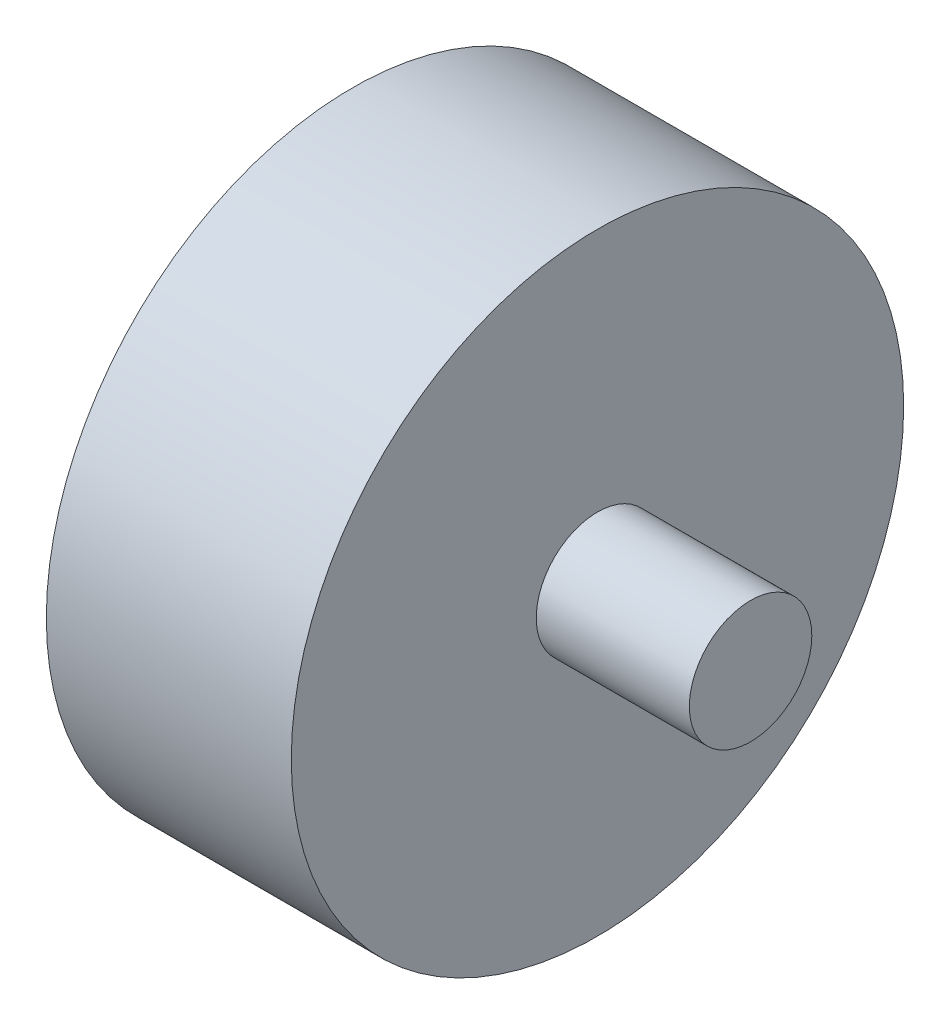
from build123d import *

# Parameters (mm, degrees)
EXTRUDE1_DEPTH      = 5.08
EXTRUDE1_DEPTH_BACK = 5.08
SKETCH1_R           = 12.7
SKETCH2_R           = 2.54
EXTRUDE2_DEPTH      = 6.35
EXTRUDE3_START      = 6.35
SKETCH3_R           = 2.54
EXTRUDE3_DEPTH      = 6.35


with BuildPart() as part:
    # Sketch1 → Extrude1 (new, two sides: drawn at the far end of the back side and taken through both)
    with BuildSketch(Plane(origin=(0, 0, 0), x_dir=(0, 0, -1), z_dir=(1, 0, 0)).offset(-EXTRUDE1_DEPTH_BACK)):
        Circle(SKETCH1_R)
    extrude(amount=EXTRUDE1_DEPTH + EXTRUDE1_DEPTH_BACK)

    # Sketch2 → Extrude2 (add)
    with BuildSketch(Plane(origin=(5.08, 0, 0), x_dir=(0, 0, -1), z_dir=(1, 0, 0))):
        Circle(SKETCH2_R)
    extrude(amount=EXTRUDE2_DEPTH)

    # Sketch3 → Extrude3 (add)
    with BuildSketch(Plane.ZY.offset(5.08).offset(EXTRUDE3_START)):
        with Locations(Location((0, 0, 0), (0, 0, 180))):
            Circle(SKETCH3_R)
    extrude(amount=-EXTRUDE3_DEPTH)


solid = part.part
